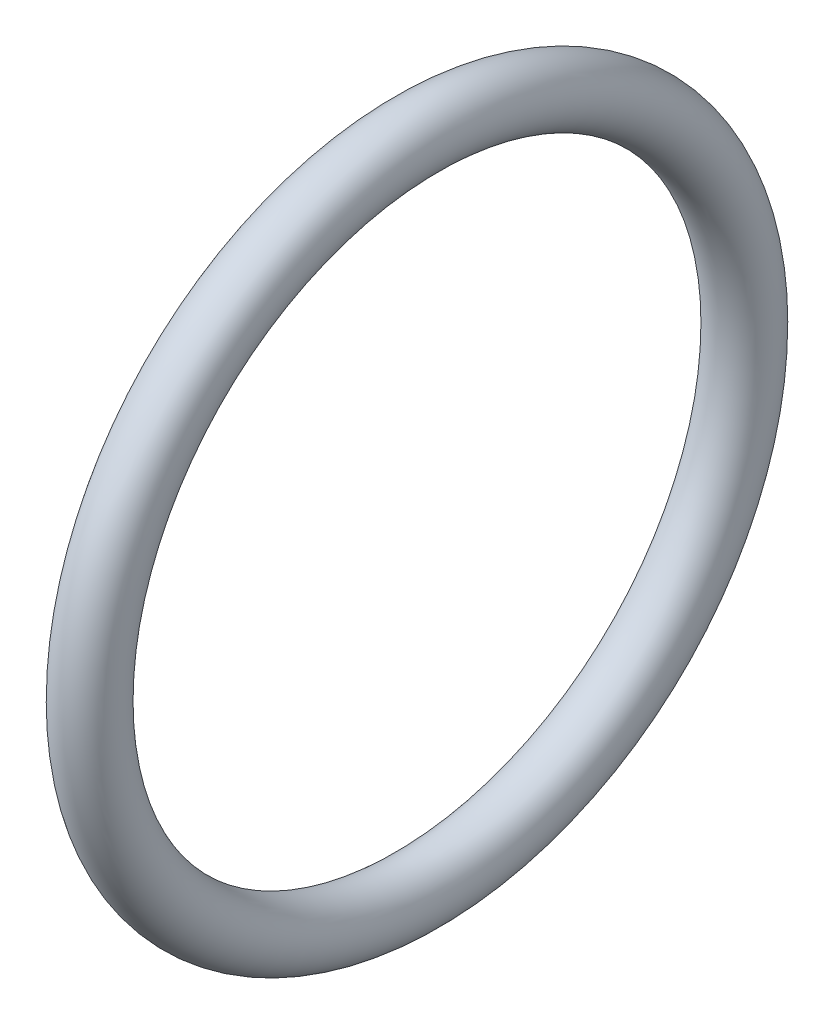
from build123d import *

# Parameters (mm, degrees)
SKETCH1_R = 0.889


with BuildPart() as part:
    # Sketch1 → Base-Revolve (revolve)
    with BuildSketch(Plane.XY, mode=Mode.PRIVATE) as base_revolve_sk:
        with Locations((0, 9.4742)):
            Circle(SKETCH1_R)
    revolve(base_revolve_sk.sketch.rotate(Axis((0, 0, 0), (1, 0, 0)), 90), axis=Axis((0, 0, 0), (1, 0, 0)))


solid = part.part
